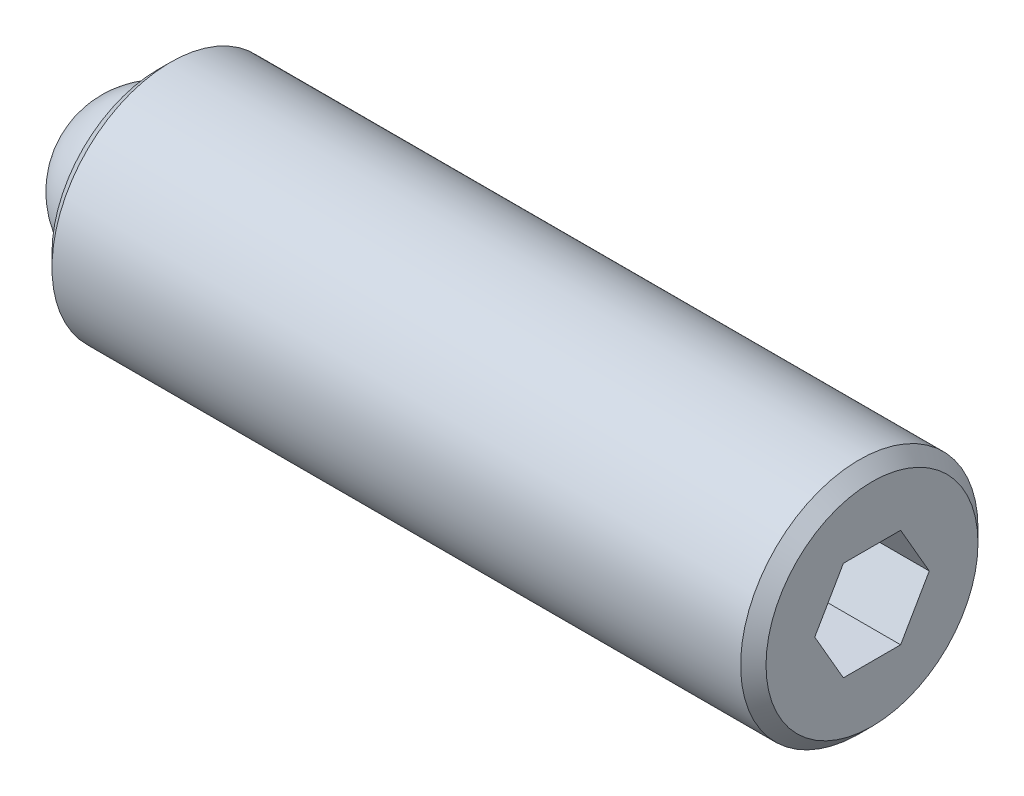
from build123d import *

# Parameters (mm, degrees)
SKETCH2_R           = 2.3749
BOSS_EXTRUDE1_DEPTH = 14.2875
CHAMFER1_SIZE       = 0.254
CHAMFER2_SIZE       = 0.254
CUT_EXTRUDE2_DEPTH  = 2.286
SKETCH3_R           = 1.5875
CUT_EXTRUDE3_DEPTH  = 1.5875


with BuildPart() as part:
    # Sketch2 → Boss-Extrude1 (new body)
    with BuildSketch(Plane(origin=(0, 0, 0), x_dir=(0, 0, -1), z_dir=(1, 0, 0))):
        Circle(SKETCH2_R)
    extrude(amount=BOSS_EXTRUDE1_DEPTH)

    # Chamfer1
    chamfer1_edges = [part.edges().sort_by_distance(p)[0] for p in [
        (0, 0, 2.3749),
    ]]
    chamfer(chamfer1_edges, length=CHAMFER1_SIZE)

    # Chamfer2
    chamfer2_edges = [part.edges().sort_by_distance(p)[0] for p in [
        (14.2875, 0, 2.3749),
    ]]
    chamfer(chamfer2_edges, length=CHAMFER2_SIZE)

    # Sketch4 → Cut-Extrude2 (cut)
    with BuildSketch(Plane(origin=(14.2875, 0, 0), x_dir=(0, 0, -1), z_dir=(1, 0, 0))):
        Polygon((1.14567944, 0), (0.57283972, 0.9921875), (-0.57283972, 0.9921875), (-1.14567944, 0), (-0.57283972, -0.9921875), (0.57283972, -0.9921875), align=None)
    extrude(amount=-CUT_EXTRUDE2_DEPTH, mode=Mode.SUBTRACT)

    # Sketch3 → Cut-Extrude3 (cut)
    with BuildSketch(Plane.ZY):
        Circle(SKETCH3_R)
    extrude(amount=-CUT_EXTRUDE3_DEPTH, mode=Mode.SUBTRACT)


with BuildPart() as body_2:
    # Sketch5 → Revolve1 (revolve)
    with BuildSketch(Plane.ZY):
        with BuildLine():
            Line((0, 0), (0, -1.5875))
            ThreePointArc((0, -1.5875), (-1.5875, 0), (0, 1.5875))
            Line((0, 1.5875), (0, 0))
        make_face()
    revolve(axis=Axis((0, 0, 0), (0, 1, 0)))


solid = Compound([part.part, body_2.part])
